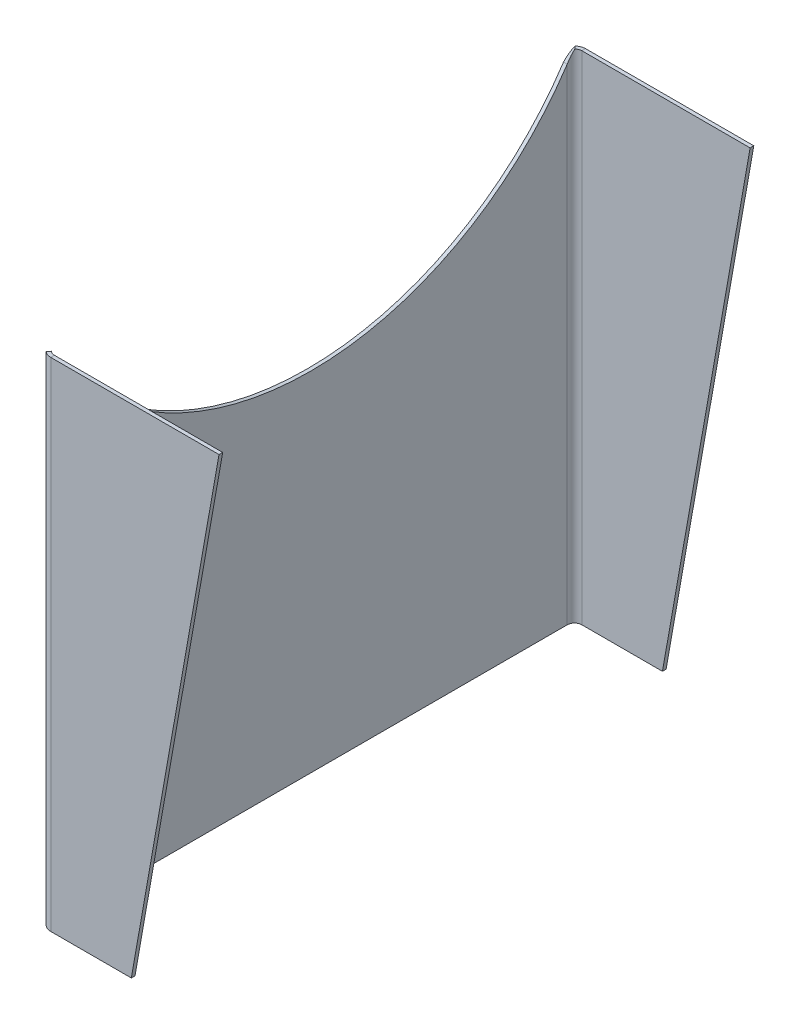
ISO-10303-21;
HEADER;
FILE_DESCRIPTION(('STEP AP214'),'2;1');
FILE_NAME('part.step','',(''),(''),'','','');
FILE_SCHEMA(('AUTOMOTIVE_DESIGN { 1 0 10303 214 1 1 1 1 }'));
ENDSEC;
DATA;
#1=APPLICATION_CONTEXT('core data for automotive mechanical design processes');
#2=APPLICATION_PROTOCOL_DEFINITION('international standard','automotive_design',2000,#1);
#3=PRODUCT_CONTEXT('',#1,'mechanical');
#4=PRODUCT('Part','Part','',(#3));
#5=PRODUCT_RELATED_PRODUCT_CATEGORY('part','',(#4));
#6=PRODUCT_DEFINITION_FORMATION('','',#4);
#7=PRODUCT_DEFINITION_CONTEXT('part definition',#1,'design');
#8=PRODUCT_DEFINITION('design','',#6,#7);
#9=PRODUCT_DEFINITION_SHAPE('','',#8);
#10=(LENGTH_UNIT() NAMED_UNIT(*) SI_UNIT(.MILLI.,.METRE.));
#11=(NAMED_UNIT(*) PLANE_ANGLE_UNIT() SI_UNIT($,.RADIAN.));
#12=(NAMED_UNIT(*) SI_UNIT($,.STERADIAN.) SOLID_ANGLE_UNIT());
#13=UNCERTAINTY_MEASURE_WITH_UNIT(LENGTH_MEASURE(1.E-05),#10,'distance_accuracy_value','');
#14=(GEOMETRIC_REPRESENTATION_CONTEXT(3) GLOBAL_UNCERTAINTY_ASSIGNED_CONTEXT((#13)) GLOBAL_UNIT_ASSIGNED_CONTEXT((#10,
#11,#12)) REPRESENTATION_CONTEXT('',''));
#15=CARTESIAN_POINT('',(0.,0.,0.));
#16=DIRECTION('',(0.,0.,1.));
#17=DIRECTION('',(1.,0.,0.));
#18=AXIS2_PLACEMENT_3D('',#15,#16,#17);
#19=CARTESIAN_POINT('',(-1219.2,-1136.65,-457.2));
#20=DIRECTION('',(1.,0.,0.));
#21=DIRECTION('',(0.,0.,-1.));
#22=AXIS2_PLACEMENT_3D('',#19,#20,#21);
#23=PLANE('',#22);
#24=DIRECTION('',(0.,1.,0.));
#25=VECTOR('',#24,1.);
#26=CARTESIAN_POINT('',(-1219.2,-1136.65,-444.5));
#27=LINE('',#26,#25);
#28=CARTESIAN_POINT('',(-1219.2,-1136.65,-444.5));
#29=VERTEX_POINT('',#28);
#30=CARTESIAN_POINT('',(-1219.2,-294.847943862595,-444.5));
#31=VERTEX_POINT('',#30);
#32=EDGE_CURVE('E470',#29,#31,#27,.T.);
#33=ORIENTED_EDGE('',*,*,#32,.T.);
#34=CARTESIAN_POINT('',(-1219.2,0.,0.));
#35=DIRECTION('',(1.,0.,0.));
#36=DIRECTION('',(0.,0.,-1.));
#37=AXIS2_PLACEMENT_3D('',#34,#35,#36);
#38=CIRCLE('',#37,533.4);
#39=CARTESIAN_POINT('',(-1219.2,-294.847943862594,444.5));
#40=VERTEX_POINT('',#39);
#41=EDGE_CURVE('E66',#40,#31,#38,.T.);
#42=ORIENTED_EDGE('',*,*,#41,.F.);
#43=DIRECTION('',(0.,1.,0.));
#44=VECTOR('',#43,1.);
#45=CARTESIAN_POINT('',(-1219.2,-1136.65,444.5));
#46=LINE('',#45,#44);
#47=CARTESIAN_POINT('',(-1219.2,-1136.65,444.5));
#48=VERTEX_POINT('',#47);
#49=EDGE_CURVE('E59',#48,#40,#46,.T.);
#50=ORIENTED_EDGE('',*,*,#49,.F.);
#51=DIRECTION('',(0.,0.,-1.));
#52=VECTOR('',#51,1.);
#53=CARTESIAN_POINT('',(-1219.2,-1136.65,-457.2));
#54=LINE('',#53,#52);
#55=EDGE_CURVE('E74',#48,#29,#54,.T.);
#56=ORIENTED_EDGE('',*,*,#55,.T.);
#57=EDGE_LOOP('',(#33,#42,#50,#56));
#58=FACE_BOUND('',#57,.T.);
#59=ADVANCED_FACE('F50',(#58),#23,.T.);
#60=CARTESIAN_POINT('',(-1225.55,-1136.65,-457.2));
#61=DIRECTION('',(1.,0.,0.));
#62=DIRECTION('',(0.,0.,-1.));
#63=AXIS2_PLACEMENT_3D('',#60,#61,#62);
#64=PLANE('',#63);
#65=CARTESIAN_POINT('',(-1225.55,0.,0.));
#66=DIRECTION('',(1.,0.,0.));
#67=DIRECTION('',(0.,0.,-1.));
#68=AXIS2_PLACEMENT_3D('',#65,#66,#67);
#69=CIRCLE('',#68,533.4);
#70=CARTESIAN_POINT('',(-1225.55,-294.847943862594,444.5));
#71=VERTEX_POINT('',#70);
#72=CARTESIAN_POINT('',(-1225.55,-294.847943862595,-444.5));
#73=VERTEX_POINT('',#72);
#74=EDGE_CURVE('E464',#71,#73,#69,.T.);
#75=ORIENTED_EDGE('',*,*,#74,.T.);
#76=DIRECTION('',(0.,1.,0.));
#77=VECTOR('',#76,1.);
#78=CARTESIAN_POINT('',(-1225.55,-1136.65,-444.5));
#79=LINE('',#78,#77);
#80=CARTESIAN_POINT('',(-1225.55,-1136.65,-444.5));
#81=VERTEX_POINT('',#80);
#82=EDGE_CURVE('E466',#81,#73,#79,.T.);
#83=ORIENTED_EDGE('',*,*,#82,.F.);
#84=DIRECTION('',(0.,0.,-1.));
#85=VECTOR('',#84,1.);
#86=CARTESIAN_POINT('',(-1225.55,-1136.65,-457.2));
#87=LINE('',#86,#85);
#88=CARTESIAN_POINT('',(-1225.55,-1136.65,444.5));
#89=VERTEX_POINT('',#88);
#90=EDGE_CURVE('E456',#89,#81,#87,.T.);
#91=ORIENTED_EDGE('',*,*,#90,.F.);
#92=DIRECTION('',(0.,1.,0.));
#93=VECTOR('',#92,1.);
#94=CARTESIAN_POINT('',(-1225.55,-1136.65,444.5));
#95=LINE('',#94,#93);
#96=EDGE_CURVE('E469',#89,#71,#95,.T.);
#97=ORIENTED_EDGE('',*,*,#96,.T.);
#98=EDGE_LOOP('',(#75,#83,#91,#97));
#99=FACE_BOUND('',#98,.T.);
#100=ADVANCED_FACE('F539',(#99),#64,.F.);
#101=CARTESIAN_POINT('',(-1206.5,-1136.65,463.55));
#102=DIRECTION('',(0.,-1.,0.));
#103=DIRECTION('',(0.,0.,-1.));
#104=AXIS2_PLACEMENT_3D('',#101,#102,#103);
#105=PLANE('',#104);
#106=ORIENTED_EDGE('',*,*,#55,.F.);
#107=DIRECTION('',(-1.,0.,0.));
#108=VECTOR('',#107,1.);
#109=CARTESIAN_POINT('',(-1219.2,-1136.65,444.5));
#110=LINE('',#109,#108);
#111=EDGE_CURVE('E504',#48,#89,#110,.T.);
#112=ORIENTED_EDGE('',*,*,#111,.T.);
#113=ORIENTED_EDGE('',*,*,#90,.T.);
#114=DIRECTION('',(1.,0.,0.));
#115=VECTOR('',#114,1.);
#116=CARTESIAN_POINT('',(-1225.55,-1136.65,-444.5));
#117=LINE('',#116,#115);
#118=EDGE_CURVE('E467',#81,#29,#117,.T.);
#119=ORIENTED_EDGE('',*,*,#118,.T.);
#120=EDGE_LOOP('',(#106,#112,#113,#119));
#121=FACE_BOUND('',#120,.T.);
#122=ADVANCED_FACE('F52',(#121),#105,.T.);
#123=CARTESIAN_POINT('',(-1219.2,0.,0.));
#124=DIRECTION('',(1.,0.,0.));
#125=DIRECTION('',(0.,0.,-1.));
#126=AXIS2_PLACEMENT_3D('',#123,#124,#125);
#127=CYLINDRICAL_SURFACE('',#126,533.4);
#128=ORIENTED_EDGE('',*,*,#41,.T.);
#129=CARTESIAN_POINT('',(-1225.55,-294.847943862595,-444.5));
#130=CARTESIAN_POINT('',(-1219.2,-294.847943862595,-444.5));
#131=B_SPLINE_CURVE_WITH_KNOTS('',1,(#129,#130),.UNSPECIFIED.,.F.,.F.,(2,2),(0.,1.),.UNSPECIFIED.);
#132=EDGE_CURVE('E452',#31,#73,#131,.F.);
#133=ORIENTED_EDGE('',*,*,#132,.T.);
#134=ORIENTED_EDGE('',*,*,#74,.F.);
#135=CARTESIAN_POINT('',(-1219.2,-294.847943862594,444.5));
#136=CARTESIAN_POINT('',(-1225.55,-294.847943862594,444.5));
#137=B_SPLINE_CURVE_WITH_KNOTS('',1,(#135,#136),.UNSPECIFIED.,.F.,.F.,(2,2),(0.,1.),.UNSPECIFIED.);
#138=EDGE_CURVE('E12',#40,#71,#137,.T.);
#139=ORIENTED_EDGE('',*,*,#138,.F.);
#140=EDGE_LOOP('',(#128,#133,#134,#139));
#141=FACE_BOUND('',#140,.T.);
#142=ADVANCED_FACE('F416',(#141),#127,.F.);
#143=CARTESIAN_POINT('',(-1225.55,-294.847943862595,-444.5));
#144=CARTESIAN_POINT('',(-1225.55,-293.414678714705,-445.670197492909));
#145=CARTESIAN_POINT('',(-1225.44567209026,-292.235169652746,-446.62791561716));
#146=CARTESIAN_POINT('',(-1225.21935583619,-290.381281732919,-448.112787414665));
#147=CARTESIAN_POINT('',(-1225.09738666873,-289.707299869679,-448.641259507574));
#148=CARTESIAN_POINT('',(-1225.0000931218,-289.181025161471,-449.044881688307));
#149=CARTESIAN_POINT('',(-1224.98318728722,-289.091580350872,-449.112756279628));
#150=CARTESIAN_POINT('',(-1224.96228928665,-288.981128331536,-449.195442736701));
#151=CARTESIAN_POINT('',(-1224.95606425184,-288.948263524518,-449.219816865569));
#152=CARTESIAN_POINT('',(-1224.94925633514,-288.912123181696,-449.24631126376));
#153=CARTESIAN_POINT('',(-1224.94943733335,-288.913045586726,-449.245646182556));
#154=CARTESIAN_POINT('',(-1224.93948737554,-288.860206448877,-449.284161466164));
#155=CARTESIAN_POINT('',(-1224.93448223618,-288.833790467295,-449.303411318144));
#156=CARTESIAN_POINT('',(-1224.91937641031,-288.754553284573,-449.361137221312));
#157=CARTESIAN_POINT('',(-1224.90918531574,-288.701742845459,-449.399589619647));
#158=CARTESIAN_POINT('',(-1224.81638236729,-288.226578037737,-449.745370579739));
#159=CARTESIAN_POINT('',(-1224.72618725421,-287.805127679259,-450.050664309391));
#160=CARTESIAN_POINT('',(-1224.43283059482,-286.543531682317,-450.959194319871));
#161=CARTESIAN_POINT('',(-1224.20687905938,-285.706141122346,-451.555072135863));
#162=CARTESIAN_POINT('',(-1223.69648079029,-284.038706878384,-452.721232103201));
#163=CARTESIAN_POINT('',(-1223.41451624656,-283.216122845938,-453.287585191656));
#164=CARTESIAN_POINT('',(-1222.77818951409,-281.529136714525,-454.416806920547));
#165=CARTESIAN_POINT('',(-1222.43118982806,-280.684229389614,-454.965166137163));
#166=CARTESIAN_POINT('',(-1221.30909556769,-278.145264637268,-456.552934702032));
#167=CARTESIAN_POINT('',(-1220.45265485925,-276.446972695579,-457.534798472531));
#168=CARTESIAN_POINT('',(-1219.50555484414,-274.743007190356,-458.419699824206));
#169=CARTESIAN_POINT('',(-1219.2,-294.847943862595,-444.5));
#170=CARTESIAN_POINT('',(-1219.2,-293.414848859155,-445.280039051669));
#171=CARTESIAN_POINT('',(-1219.13044806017,-292.235169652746,-445.91861041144));
#172=CARTESIAN_POINT('',(-1218.97957055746,-290.381281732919,-446.90852494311));
#173=CARTESIAN_POINT('',(-1218.89825777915,-289.707299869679,-447.260839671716));
#174=CARTESIAN_POINT('',(-1218.83339541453,-289.181025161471,-447.529921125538));
#175=CARTESIAN_POINT('',(-1218.82212485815,-289.091580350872,-447.575170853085));
#176=CARTESIAN_POINT('',(-1218.80819285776,-288.981128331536,-447.630295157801));
#177=CARTESIAN_POINT('',(-1218.80404283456,-288.948263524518,-447.646544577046));
#178=CARTESIAN_POINT('',(-1218.79950422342,-288.912123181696,-447.664207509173));
#179=CARTESIAN_POINT('',(-1218.7996248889,-288.913045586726,-447.663764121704));
#180=CARTESIAN_POINT('',(-1218.7929915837,-288.860206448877,-447.689440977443));
#181=CARTESIAN_POINT('',(-1218.78965482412,-288.833790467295,-447.702274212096));
#182=CARTESIAN_POINT('',(-1218.77958427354,-288.754553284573,-447.740758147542));
#183=CARTESIAN_POINT('',(-1218.7727902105,-288.701742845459,-447.766393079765));
#184=CARTESIAN_POINT('',(-1218.71092157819,-288.226578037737,-447.996913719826));
#185=CARTESIAN_POINT('',(-1218.65079150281,-287.805127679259,-448.200442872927));
#186=CARTESIAN_POINT('',(-1218.45522039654,-286.543531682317,-448.80612954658));
#187=CARTESIAN_POINT('',(-1218.30458603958,-285.706141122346,-449.203381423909));
#188=CARTESIAN_POINT('',(-1217.96432052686,-284.038706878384,-449.980821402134));
#189=CARTESIAN_POINT('',(-1217.77634416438,-283.216122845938,-450.358390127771));
#190=CARTESIAN_POINT('',(-1217.35212634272,-281.529136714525,-451.111204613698));
#191=CARTESIAN_POINT('',(-1217.12079321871,-280.684229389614,-451.476777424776));
#192=CARTESIAN_POINT('',(-1216.37273037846,-278.145264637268,-452.535289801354));
#193=CARTESIAN_POINT('',(-1215.80176855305,-276.446969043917,-453.189866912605));
#194=CARTESIAN_POINT('',(-1215.1703698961,-274.743007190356,-453.779799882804));
#195=B_SPLINE_SURFACE_WITH_KNOTS('',1,3,((#143,#144,#145,#146,#147,#148,#149,#150,#151,#152,
#153,#154,#155,#156,#157,#158,#159,#160,#161,#162,#163,#164,#165,#166,#167,#168),(#169,#170,
#171,#172,#173,#174,#175,#176,#177,#178,#179,#180,#181,#182,#183,#184,#185,#186,#187,#188,#189,
#190,#191,#192,#193,#194)),.UNSPECIFIED.,.F.,.F.,.F.,(2,2),(4,2,2,2,2,2,2,2,2,2,2,2,4),(0.,1.),
(0.,0.125,0.25,0.28125,0.296875,0.30078125,0.3046875,0.3125,0.375,0.5,0.625,0.75,1.),.UNSPECIFIED.);
#196=CARTESIAN_POINT('',(-1219.2,-294.847943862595,-444.5));
#197=CARTESIAN_POINT('',(-1219.2,-293.414848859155,-445.280039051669));
#198=CARTESIAN_POINT('',(-1219.13044806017,-292.235169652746,-445.91861041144));
#199=CARTESIAN_POINT('',(-1218.97957055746,-290.381281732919,-446.90852494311));
#200=CARTESIAN_POINT('',(-1218.89825777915,-289.707299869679,-447.260839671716));
#201=CARTESIAN_POINT('',(-1218.83339541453,-289.181025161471,-447.529921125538));
#202=CARTESIAN_POINT('',(-1218.82212485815,-289.091580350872,-447.575170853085));
#203=CARTESIAN_POINT('',(-1218.80819285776,-288.981128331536,-447.630295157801));
#204=CARTESIAN_POINT('',(-1218.80404283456,-288.948263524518,-447.646544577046));
#205=CARTESIAN_POINT('',(-1218.79950422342,-288.912123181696,-447.664207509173));
#206=CARTESIAN_POINT('',(-1218.7996248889,-288.913045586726,-447.663764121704));
#207=CARTESIAN_POINT('',(-1218.7929915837,-288.860206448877,-447.689440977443));
#208=CARTESIAN_POINT('',(-1218.78965482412,-288.833790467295,-447.702274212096));
#209=CARTESIAN_POINT('',(-1218.77958427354,-288.754553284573,-447.740758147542));
#210=CARTESIAN_POINT('',(-1218.7727902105,-288.701742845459,-447.766393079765));
#211=CARTESIAN_POINT('',(-1218.71092157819,-288.226578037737,-447.996913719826));
#212=CARTESIAN_POINT('',(-1218.65079150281,-287.805127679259,-448.200442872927));
#213=CARTESIAN_POINT('',(-1218.45522039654,-286.543531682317,-448.80612954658));
#214=CARTESIAN_POINT('',(-1218.30458603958,-285.706141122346,-449.203381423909));
#215=CARTESIAN_POINT('',(-1217.96432052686,-284.038706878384,-449.980821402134));
#216=CARTESIAN_POINT('',(-1217.77634416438,-283.216122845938,-450.358390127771));
#217=CARTESIAN_POINT('',(-1217.35212634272,-281.529136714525,-451.111204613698));
#218=CARTESIAN_POINT('',(-1217.12079321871,-280.684229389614,-451.476777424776));
#219=CARTESIAN_POINT('',(-1216.37273037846,-278.145264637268,-452.535289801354));
#220=CARTESIAN_POINT('',(-1215.80176855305,-276.446969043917,-453.189866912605));
#221=CARTESIAN_POINT('',(-1215.1703698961,-274.743007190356,-453.779799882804));
#222=B_SPLINE_CURVE_WITH_KNOTS('',3,(#196,#197,#198,#199,#200,#201,#202,#203,#204,#205,#206,
#207,#208,#209,#210,#211,#212,#213,#214,#215,#216,#217,#218,#219,#220,#221),.UNSPECIFIED.,.F.,
.F.,(4,2,2,2,2,2,2,2,2,2,2,2,4),(0.,0.125,0.25,0.28125,0.296875,0.30078125,0.3046875,0.3125,
0.375,0.5,0.625,0.75,1.),.UNSPECIFIED.);
#223=CARTESIAN_POINT('',(-1215.1703698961,-274.743007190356,-453.779799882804));
#224=VERTEX_POINT('',#223);
#225=EDGE_CURVE('E312',#31,#224,#222,.T.);
#226=CARTESIAN_POINT('',(-1215.1703698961,-274.743007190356,-453.779799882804));
#227=CARTESIAN_POINT('',(-1219.50555484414,-274.743007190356,-458.419699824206));
#228=B_SPLINE_CURVE_WITH_KNOTS('',1,(#226,#227),.UNSPECIFIED.,.F.,.F.,(2,2),(0.,1.),.UNSPECIFIED.);
#229=CARTESIAN_POINT('',(-1219.50555484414,-274.743007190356,-458.419699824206));
#230=VERTEX_POINT('',#229);
#231=EDGE_CURVE('E345',#224,#230,#228,.T.);
#232=CARTESIAN_POINT('',(-1219.50555484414,-274.743007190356,-458.419699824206));
#233=CARTESIAN_POINT('',(-1220.45265485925,-276.446972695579,-457.534798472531));
#234=CARTESIAN_POINT('',(-1221.30909556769,-278.145264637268,-456.552934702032));
#235=CARTESIAN_POINT('',(-1222.43118982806,-280.684229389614,-454.965166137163));
#236=CARTESIAN_POINT('',(-1222.77818951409,-281.529136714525,-454.416806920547));
#237=CARTESIAN_POINT('',(-1223.41451624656,-283.216122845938,-453.287585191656));
#238=CARTESIAN_POINT('',(-1223.69648079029,-284.038706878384,-452.721232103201));
#239=CARTESIAN_POINT('',(-1224.20687905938,-285.706141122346,-451.555072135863));
#240=CARTESIAN_POINT('',(-1224.43283059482,-286.543531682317,-450.959194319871));
#241=CARTESIAN_POINT('',(-1224.72618725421,-287.805127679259,-450.050664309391));
#242=CARTESIAN_POINT('',(-1224.81638236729,-288.226578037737,-449.745370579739));
#243=CARTESIAN_POINT('',(-1224.90918531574,-288.701742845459,-449.399589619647));
#244=CARTESIAN_POINT('',(-1224.91937641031,-288.754553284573,-449.361137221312));
#245=CARTESIAN_POINT('',(-1224.93448223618,-288.833790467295,-449.303411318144));
#246=CARTESIAN_POINT('',(-1224.93948737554,-288.860206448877,-449.284161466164));
#247=CARTESIAN_POINT('',(-1224.94943733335,-288.913045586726,-449.245646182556));
#248=CARTESIAN_POINT('',(-1224.94925633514,-288.912123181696,-449.24631126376));
#249=CARTESIAN_POINT('',(-1224.95606425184,-288.948263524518,-449.219816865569));
#250=CARTESIAN_POINT('',(-1224.96228928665,-288.981128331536,-449.195442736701));
#251=CARTESIAN_POINT('',(-1224.98318728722,-289.091580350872,-449.112756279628));
#252=CARTESIAN_POINT('',(-1225.0000931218,-289.181025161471,-449.044881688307));
#253=CARTESIAN_POINT('',(-1225.09738666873,-289.707299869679,-448.641259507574));
#254=CARTESIAN_POINT('',(-1225.21935583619,-290.381281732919,-448.112787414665));
#255=CARTESIAN_POINT('',(-1225.44567209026,-292.235169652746,-446.62791561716));
#256=CARTESIAN_POINT('',(-1225.55,-293.414678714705,-445.670197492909));
#257=CARTESIAN_POINT('',(-1225.55,-294.847943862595,-444.5));
#258=B_SPLINE_CURVE_WITH_KNOTS('',3,(#232,#233,#234,#235,#236,#237,#238,#239,#240,#241,#242,
#243,#244,#245,#246,#247,#248,#249,#250,#251,#252,#253,#254,#255,#256,#257),.UNSPECIFIED.,.F.,
.F.,(4,2,2,2,2,2,2,2,2,2,2,2,4),(0.,0.25,0.375,0.5,0.625,0.6875,0.6953125,0.69921875,0.703125,
0.71875,0.75,0.875,1.),.UNSPECIFIED.);
#259=EDGE_CURVE('E349',#73,#230,#258,.F.);
#260=ORIENTED_EDGE('',*,*,#132,.F.);
#261=ORIENTED_EDGE('',*,*,#225,.T.);
#262=ORIENTED_EDGE('',*,*,#231,.T.);
#263=ORIENTED_EDGE('',*,*,#259,.F.);
#264=EDGE_LOOP('',(#260,#261,#262,#263));
#265=FACE_BOUND('',#264,.T.);
#266=ADVANCED_FACE('F405',(#265),#195,.T.);
#267=CARTESIAN_POINT('',(-1206.5,-274.743007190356,-444.5));
#268=DIRECTION('',(0.,1.,0.));
#269=DIRECTION('',(0.,0.,1.));
#270=AXIS2_PLACEMENT_3D('',#267,#268,#269);
#271=PLANE('',#270);
#272=ORIENTED_EDGE('',*,*,#231,.F.);
#273=CARTESIAN_POINT('',(-1206.5,-274.743007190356,-444.5));
#274=DIRECTION('',(0.,-1.,0.));
#275=DIRECTION('',(0.,0.,-1.));
#276=AXIS2_PLACEMENT_3D('',#273,#274,#275);
#277=CIRCLE('',#276,12.7);
#278=CARTESIAN_POINT('',(-1206.5,-274.743007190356,-457.2));
#279=VERTEX_POINT('',#278);
#280=EDGE_CURVE('E350',#224,#279,#277,.T.);
#281=ORIENTED_EDGE('',*,*,#280,.T.);
#282=DIRECTION('',(0.,0.,1.));
#283=VECTOR('',#282,1.);
#284=CARTESIAN_POINT('',(-1206.5,-274.743007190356,-463.55));
#285=LINE('',#284,#283);
#286=CARTESIAN_POINT('',(-1206.5,-274.743007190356,-463.55));
#287=VERTEX_POINT('',#286);
#288=EDGE_CURVE('E324',#287,#279,#285,.T.);
#289=ORIENTED_EDGE('',*,*,#288,.F.);
#290=CARTESIAN_POINT('',(-1206.5,-274.743007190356,-444.5));
#291=DIRECTION('',(0.,-1.,0.));
#292=DIRECTION('',(0.,0.,-1.));
#293=AXIS2_PLACEMENT_3D('',#290,#291,#292);
#294=CIRCLE('',#293,19.05);
#295=EDGE_CURVE('E346',#230,#287,#294,.T.);
#296=ORIENTED_EDGE('',*,*,#295,.F.);
#297=EDGE_LOOP('',(#272,#281,#289,#296));
#298=FACE_BOUND('',#297,.T.);
#299=ADVANCED_FACE('F381',(#298),#271,.T.);
#300=CARTESIAN_POINT('',(-1206.5,-1136.65,-444.5));
#301=DIRECTION('',(0.,-1.,0.));
#302=DIRECTION('',(0.,0.,-1.));
#303=AXIS2_PLACEMENT_3D('',#300,#301,#302);
#304=PLANE('',#303);
#305=CARTESIAN_POINT('',(-1206.5,-1136.65,-444.5));
#306=DIRECTION('',(0.,-1.,0.));
#307=DIRECTION('',(0.,0.,-1.));
#308=AXIS2_PLACEMENT_3D('',#305,#306,#307);
#309=CIRCLE('',#308,12.7);
#310=CARTESIAN_POINT('',(-1206.5,-1136.65,-457.2));
#311=VERTEX_POINT('',#310);
#312=EDGE_CURVE('E347',#311,#29,#309,.F.);
#313=ORIENTED_EDGE('',*,*,#312,.T.);
#314=ORIENTED_EDGE('',*,*,#118,.F.);
#315=CARTESIAN_POINT('',(-1206.5,-1136.65,-444.5));
#316=DIRECTION('',(0.,1.,0.));
#317=DIRECTION('',(0.,0.,1.));
#318=AXIS2_PLACEMENT_3D('',#315,#316,#317);
#319=CIRCLE('',#318,19.05);
#320=CARTESIAN_POINT('',(-1206.5,-1136.65,-463.55));
#321=VERTEX_POINT('',#320);
#322=EDGE_CURVE('E342',#321,#81,#319,.T.);
#323=ORIENTED_EDGE('',*,*,#322,.F.);
#324=DIRECTION('',(0.,0.,-1.));
#325=VECTOR('',#324,1.);
#326=CARTESIAN_POINT('',(-1206.5,-1136.65,-457.2));
#327=LINE('',#326,#325);
#328=EDGE_CURVE('E305',#311,#321,#327,.T.);
#329=ORIENTED_EDGE('',*,*,#328,.F.);
#330=EDGE_LOOP('',(#313,#314,#323,#329));
#331=FACE_BOUND('',#330,.T.);
#332=ADVANCED_FACE('F372',(#331),#304,.T.);
#333=CARTESIAN_POINT('',(-1206.5,146.525234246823,-444.5));
#334=DIRECTION('',(0.,-1.,0.));
#335=DIRECTION('',(0.,0.,-1.));
#336=AXIS2_PLACEMENT_3D('',#333,#334,#335);
#337=CYLINDRICAL_SURFACE('',#336,19.05);
#338=DIRECTION('',(0.,1.,0.));
#339=VECTOR('',#338,1.);
#340=CARTESIAN_POINT('',(-1206.5,-1136.65,-463.55));
#341=LINE('',#340,#339);
#342=EDGE_CURVE('E331',#321,#287,#341,.T.);
#343=ORIENTED_EDGE('',*,*,#342,.F.);
#344=ORIENTED_EDGE('',*,*,#322,.T.);
#345=ORIENTED_EDGE('',*,*,#82,.T.);
#346=ORIENTED_EDGE('',*,*,#259,.T.);
#347=ORIENTED_EDGE('',*,*,#295,.T.);
#348=EDGE_LOOP('',(#343,#344,#345,#346,#347));
#349=FACE_BOUND('',#348,.T.);
#350=ADVANCED_FACE('F361',(#349),#337,.T.);
#351=CARTESIAN_POINT('',(-1206.5,146.525234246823,-444.5));
#352=DIRECTION('',(0.,-1.,0.));
#353=DIRECTION('',(0.,0.,-1.));
#354=AXIS2_PLACEMENT_3D('',#351,#352,#353);
#355=CYLINDRICAL_SURFACE('',#354,12.7);
#356=DIRECTION('',(0.,1.,0.));
#357=VECTOR('',#356,1.);
#358=CARTESIAN_POINT('',(-1206.5,-1136.65,-457.2));
#359=LINE('',#358,#357);
#360=EDGE_CURVE('E339',#311,#279,#359,.T.);
#361=ORIENTED_EDGE('',*,*,#360,.T.);
#362=ORIENTED_EDGE('',*,*,#280,.F.);
#363=ORIENTED_EDGE('',*,*,#225,.F.);
#364=ORIENTED_EDGE('',*,*,#32,.F.);
#365=ORIENTED_EDGE('',*,*,#312,.F.);
#366=EDGE_LOOP('',(#361,#362,#363,#364,#365));
#367=FACE_BOUND('',#366,.T.);
#368=ADVANCED_FACE('F371',(#367),#355,.F.);
#369=CARTESIAN_POINT('',(-1066.8,-1136.65,-1187.97202403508));
#370=DIRECTION('',(0.984807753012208,-0.173648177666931,0.));
#371=DIRECTION('',(0.173648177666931,0.984807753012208,0.));
#372=AXIS2_PLACEMENT_3D('',#369,#370,#371);
#373=PLANE('',#372);
#374=DIRECTION('',(0.173648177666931,0.984807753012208,0.));
#375=VECTOR('',#374,1.);
#376=CARTESIAN_POINT('',(-1071.39542229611,-1162.71193492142,-457.2));
#377=LINE('',#376,#375);
#378=CARTESIAN_POINT('',(-1066.8,-1136.65,-457.2));
#379=VERTEX_POINT('',#378);
#380=CARTESIAN_POINT('',(-914.822542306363,-274.743007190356,-457.2));
#381=VERTEX_POINT('',#380);
#382=EDGE_CURVE('E318',#379,#381,#377,.T.);
#383=ORIENTED_EDGE('',*,*,#382,.F.);
#384=DIRECTION('',(0.,0.,1.));
#385=VECTOR('',#384,1.);
#386=CARTESIAN_POINT('',(-1066.8,-1136.65,-1187.97202403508));
#387=LINE('',#386,#385);
#388=CARTESIAN_POINT('',(-1066.8,-1136.65,-463.55));
#389=VERTEX_POINT('',#388);
#390=EDGE_CURVE('E313',#389,#379,#387,.T.);
#391=ORIENTED_EDGE('',*,*,#390,.F.);
#392=DIRECTION('',(0.173648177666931,0.984807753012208,0.));
#393=VECTOR('',#392,1.);
#394=CARTESIAN_POINT('',(-1071.39542229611,-1162.71193492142,-463.55));
#395=LINE('',#394,#393);
#396=CARTESIAN_POINT('',(-914.822542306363,-274.743007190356,-463.550000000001));
#397=VERTEX_POINT('',#396);
#398=EDGE_CURVE('E336',#389,#397,#395,.T.);
#399=ORIENTED_EDGE('',*,*,#398,.T.);
#400=DIRECTION('',(0.,0.,1.));
#401=VECTOR('',#400,1.);
#402=CARTESIAN_POINT('',(-914.822542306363,-274.743007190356,-463.550000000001));
#403=LINE('',#402,#401);
#404=EDGE_CURVE('E333',#397,#381,#403,.T.);
#405=ORIENTED_EDGE('',*,*,#404,.T.);
#406=EDGE_LOOP('',(#383,#391,#399,#405));
#407=FACE_BOUND('',#406,.T.);
#408=ADVANCED_FACE('F379',(#407),#373,.T.);
#409=CARTESIAN_POINT('',(-1219.2,-1136.65,-463.55));
#410=DIRECTION('',(0.,0.,1.));
#411=DIRECTION('',(1.,0.,0.));
#412=AXIS2_PLACEMENT_3D('',#409,#410,#411);
#413=PLANE('',#412);
#414=ORIENTED_EDGE('',*,*,#398,.F.);
#415=DIRECTION('',(1.,0.,0.));
#416=VECTOR('',#415,1.);
#417=CARTESIAN_POINT('',(-1219.2,-1136.65,-463.55));
#418=LINE('',#417,#416);
#419=EDGE_CURVE('E315',#321,#389,#418,.T.);
#420=ORIENTED_EDGE('',*,*,#419,.F.);
#421=ORIENTED_EDGE('',*,*,#342,.T.);
#422=DIRECTION('',(1.,0.,0.));
#423=VECTOR('',#422,1.);
#424=CARTESIAN_POINT('',(-1219.2,-274.743007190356,-463.55));
#425=LINE('',#424,#423);
#426=EDGE_CURVE('E329',#287,#397,#425,.T.);
#427=ORIENTED_EDGE('',*,*,#426,.T.);
#428=EDGE_LOOP('',(#414,#420,#421,#427));
#429=FACE_BOUND('',#428,.T.);
#430=ADVANCED_FACE('F537',(#429),#413,.F.);
#431=CARTESIAN_POINT('',(-1206.5,-274.743007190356,-444.5));
#432=DIRECTION('',(0.,1.,0.));
#433=DIRECTION('',(-1.,0.,0.));
#434=AXIS2_PLACEMENT_3D('',#431,#432,#433);
#435=PLANE('',#434);
#436=DIRECTION('',(1.,0.,0.));
#437=VECTOR('',#436,1.);
#438=CARTESIAN_POINT('',(-1219.2,-274.743007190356,-457.2));
#439=LINE('',#438,#437);
#440=EDGE_CURVE('E327',#279,#381,#439,.T.);
#441=ORIENTED_EDGE('',*,*,#440,.T.);
#442=ORIENTED_EDGE('',*,*,#404,.F.);
#443=ORIENTED_EDGE('',*,*,#426,.F.);
#444=ORIENTED_EDGE('',*,*,#288,.T.);
#445=EDGE_LOOP('',(#441,#442,#443,#444));
#446=FACE_BOUND('',#445,.T.);
#447=ADVANCED_FACE('F524',(#446),#435,.T.);
#448=CARTESIAN_POINT('',(-1219.2,-1136.65,-457.2));
#449=DIRECTION('',(0.,0.,1.));
#450=DIRECTION('',(1.,0.,0.));
#451=AXIS2_PLACEMENT_3D('',#448,#449,#450);
#452=PLANE('',#451);
#453=DIRECTION('',(1.,0.,0.));
#454=VECTOR('',#453,1.);
#455=CARTESIAN_POINT('',(-1219.2,-1136.65,-457.2));
#456=LINE('',#455,#454);
#457=EDGE_CURVE('E321',#311,#379,#456,.T.);
#458=ORIENTED_EDGE('',*,*,#457,.T.);
#459=ORIENTED_EDGE('',*,*,#382,.T.);
#460=ORIENTED_EDGE('',*,*,#440,.F.);
#461=ORIENTED_EDGE('',*,*,#360,.F.);
#462=EDGE_LOOP('',(#458,#459,#460,#461));
#463=FACE_BOUND('',#462,.T.);
#464=ADVANCED_FACE('F529',(#463),#452,.T.);
#465=CARTESIAN_POINT('',(-1225.55,-1136.65,-444.5));
#466=DIRECTION('',(0.,-1.,0.));
#467=DIRECTION('',(0.,0.,-1.));
#468=AXIS2_PLACEMENT_3D('',#465,#466,#467);
#469=PLANE('',#468);
#470=ORIENTED_EDGE('',*,*,#419,.T.);
#471=ORIENTED_EDGE('',*,*,#390,.T.);
#472=ORIENTED_EDGE('',*,*,#457,.F.);
#473=ORIENTED_EDGE('',*,*,#328,.T.);
#474=EDGE_LOOP('',(#470,#471,#472,#473));
#475=FACE_BOUND('',#474,.T.);
#476=ADVANCED_FACE('F374',(#475),#469,.T.);
#477=CARTESIAN_POINT('',(-1206.5,-274.743007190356,444.5));
#478=DIRECTION('',(0.,1.,0.));
#479=DIRECTION('',(0.,0.,1.));
#480=AXIS2_PLACEMENT_3D('',#477,#478,#479);
#481=PLANE('',#480);
#482=DIRECTION('',(0.,0.,1.));
#483=VECTOR('',#482,1.);
#484=CARTESIAN_POINT('',(-1206.5,-274.743007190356,457.200000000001));
#485=LINE('',#484,#483);
#486=CARTESIAN_POINT('',(-1206.5,-274.743007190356,457.200000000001));
#487=VERTEX_POINT('',#486);
#488=CARTESIAN_POINT('',(-1206.5,-274.743007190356,463.550000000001));
#489=VERTEX_POINT('',#488);
#490=EDGE_CURVE('E176',#487,#489,#485,.T.);
#491=ORIENTED_EDGE('',*,*,#490,.F.);
#492=CARTESIAN_POINT('',(-1206.5,-274.743007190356,444.5));
#493=DIRECTION('',(0.,1.,0.));
#494=DIRECTION('',(0.,0.,1.));
#495=AXIS2_PLACEMENT_3D('',#492,#493,#494);
#496=CIRCLE('',#495,12.7);
#497=CARTESIAN_POINT('',(-1215.1703698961,-274.743007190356,453.779799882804));
#498=VERTEX_POINT('',#497);
#499=EDGE_CURVE('E237',#487,#498,#496,.F.);
#500=ORIENTED_EDGE('',*,*,#499,.T.);
#501=CARTESIAN_POINT('',(-1219.50555484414,-274.743007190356,458.419699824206));
#502=CARTESIAN_POINT('',(-1215.1703698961,-274.743007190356,453.779799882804));
#503=B_SPLINE_CURVE_WITH_KNOTS('',1,(#501,#502),.UNSPECIFIED.,.F.,.F.,(2,2),(0.,1.),.UNSPECIFIED.);
#504=CARTESIAN_POINT('',(-1219.50555484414,-274.743007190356,458.419699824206));
#505=VERTEX_POINT('',#504);
#506=EDGE_CURVE('E198',#498,#505,#503,.F.);
#507=ORIENTED_EDGE('',*,*,#506,.T.);
#508=CARTESIAN_POINT('',(-1206.5,-274.743007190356,444.5));
#509=DIRECTION('',(0.,-1.,0.));
#510=DIRECTION('',(0.,0.,-1.));
#511=AXIS2_PLACEMENT_3D('',#508,#509,#510);
#512=CIRCLE('',#511,19.05);
#513=EDGE_CURVE('E203',#489,#505,#512,.T.);
#514=ORIENTED_EDGE('',*,*,#513,.F.);
#515=EDGE_LOOP('',(#491,#500,#507,#514));
#516=FACE_BOUND('',#515,.T.);
#517=ADVANCED_FACE('F266',(#516),#481,.T.);
#518=CARTESIAN_POINT('',(-1219.50555484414,-274.743007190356,458.419699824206));
#519=CARTESIAN_POINT('',(-1220.43444674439,-276.447794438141,457.551810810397));
#520=CARTESIAN_POINT('',(-1221.27614623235,-278.144356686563,456.590660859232));
#521=CARTESIAN_POINT('',(-1222.38277295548,-280.676896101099,455.037743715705));
#522=CARTESIAN_POINT('',(-1222.72571944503,-281.519023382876,454.501627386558));
#523=CARTESIAN_POINT('',(-1223.19867187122,-282.779135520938,453.673759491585));
#524=CARTESIAN_POINT('',(-1223.34941563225,-283.198659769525,453.393857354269));
#525=CARTESIAN_POINT('',(-1223.56488755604,-283.827176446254,452.968610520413));
#526=CARTESIAN_POINT('',(-1223.63493785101,-284.036553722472,452.825962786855));
#527=CARTESIAN_POINT('',(-1223.73731986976,-284.350427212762,452.610709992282));
#528=CARTESIAN_POINT('',(-1223.77099832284,-284.455019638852,452.538745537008));
#529=CARTESIAN_POINT('',(-1223.82083871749,-284.611860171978,452.430487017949));
#530=CARTESIAN_POINT('',(-1223.83733930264,-284.664132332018,452.394348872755));
#531=CARTESIAN_POINT('',(-1223.86192037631,-284.742528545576,452.340064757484));
#532=CARTESIAN_POINT('',(-1223.87008576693,-284.768658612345,452.321957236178));
#533=CARTESIAN_POINT('',(-1223.882291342,-284.807850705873,452.294776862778));
#534=CARTESIAN_POINT('',(-1223.88635278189,-284.820914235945,452.285713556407));
#535=CARTESIAN_POINT('',(-1223.89243430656,-284.840508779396,452.272113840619));
#536=CARTESIAN_POINT('',(-1223.89445970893,-284.847040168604,452.267579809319));
#537=CARTESIAN_POINT('',(-1223.89850696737,-284.860102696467,452.25851016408));
#538=CARTESIAN_POINT('',(-1223.90176420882,-284.870627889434,452.251200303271));
#539=CARTESIAN_POINT('',(-1224.10343131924,-285.522626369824,451.79832595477));
#540=CARTESIAN_POINT('',(-1224.47091468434,-286.678588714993,450.958947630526));
#541=CARTESIAN_POINT('',(-1225.01333024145,-289.172283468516,449.038879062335));
#542=CARTESIAN_POINT('',(-1225.18999022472,-290.130140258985,448.288259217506));
#543=CARTESIAN_POINT('',(-1225.45838198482,-292.299104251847,446.560678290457));
#544=CARTESIAN_POINT('',(-1225.55,-293.509993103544,445.58341044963));
#545=CARTESIAN_POINT('',(-1225.55,-294.847943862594,444.5));
#546=CARTESIAN_POINT('',(-1215.1703698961,-274.743007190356,453.779799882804));
#547=CARTESIAN_POINT('',(-1215.78962995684,-276.44779111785,453.201208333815));
#548=CARTESIAN_POINT('',(-1216.3507641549,-278.144356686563,452.560440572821));
#549=CARTESIAN_POINT('',(-1217.08851530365,-280.676896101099,451.525162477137));
#550=CARTESIAN_POINT('',(-1217.31714629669,-281.519023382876,451.167751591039));
#551=CARTESIAN_POINT('',(-1217.63244791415,-282.779135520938,450.615839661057));
#552=CARTESIAN_POINT('',(-1217.73294375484,-283.198659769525,450.42923823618));
#553=CARTESIAN_POINT('',(-1217.87659170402,-283.827176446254,450.145740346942));
#554=CARTESIAN_POINT('',(-1217.92329190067,-284.036553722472,450.050641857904));
#555=CARTESIAN_POINT('',(-1217.99154657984,-284.350427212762,449.907139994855));
#556=CARTESIAN_POINT('',(-1218.0139988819,-284.455019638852,449.859163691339));
#557=CARTESIAN_POINT('',(-1218.04722581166,-284.611860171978,449.786991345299));
#558=CARTESIAN_POINT('',(-1218.05822620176,-284.664132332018,449.762899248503));
#559=CARTESIAN_POINT('',(-1218.07461358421,-284.742528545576,449.726709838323));
#560=CARTESIAN_POINT('',(-1218.08005717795,-284.768658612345,449.714638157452));
#561=CARTESIAN_POINT('',(-1218.088194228,-284.807850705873,449.696517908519));
#562=CARTESIAN_POINT('',(-1218.09090185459,-284.820914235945,449.690475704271));
#563=CARTESIAN_POINT('',(-1218.09495620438,-284.840508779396,449.68140922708));
#564=CARTESIAN_POINT('',(-1218.09630647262,-284.847040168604,449.678386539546));
#565=CARTESIAN_POINT('',(-1218.09900464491,-284.860102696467,449.672340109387));
#566=CARTESIAN_POINT('',(-1218.10117613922,-284.870627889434,449.667466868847));
#567=CARTESIAN_POINT('',(-1218.2356208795,-285.522626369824,449.365550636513));
#568=CARTESIAN_POINT('',(-1218.48060978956,-286.678588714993,448.805965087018));
#569=CARTESIAN_POINT('',(-1218.84222016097,-289.172283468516,447.52591937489));
#570=CARTESIAN_POINT('',(-1218.95999348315,-290.130140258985,447.025506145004));
#571=CARTESIAN_POINT('',(-1219.13892132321,-292.299104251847,445.873785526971));
#572=CARTESIAN_POINT('',(-1219.2,-293.510087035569,445.222222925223));
#573=CARTESIAN_POINT('',(-1219.2,-294.847943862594,444.5));
#574=B_SPLINE_SURFACE_WITH_KNOTS('',1,3,((#518,#519,#520,#521,#522,#523,#524,#525,#526,#527,
#528,#529,#530,#531,#532,#533,#534,#535,#536,#537,#538,#539,#540,#541,#542,#543,#544,#545),
(#546,#547,#548,#549,#550,#551,#552,#553,#554,#555,#556,#557,#558,#559,#560,#561,#562,#563,#564,
#565,#566,#567,#568,#569,#570,#571,#572,#573)),.UNSPECIFIED.,.F.,.F.,.F.,(2,2),(4,2,2,2,2,2,2,2,
2,2,2,2,2,4),(0.,1.),(0.,0.25,0.375,0.4375,0.46875,0.484375,0.4921875,0.49609375,0.498046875,
0.4990234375,0.5,0.75,0.875,1.),.UNSPECIFIED.);
#575=CARTESIAN_POINT('',(-1215.1703698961,-274.743007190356,453.779799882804));
#576=CARTESIAN_POINT('',(-1215.78962995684,-276.44779111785,453.201208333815));
#577=CARTESIAN_POINT('',(-1216.3507641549,-278.144356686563,452.560440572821));
#578=CARTESIAN_POINT('',(-1217.08851530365,-280.676896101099,451.525162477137));
#579=CARTESIAN_POINT('',(-1217.31714629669,-281.519023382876,451.167751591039));
#580=CARTESIAN_POINT('',(-1217.63244791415,-282.779135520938,450.615839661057));
#581=CARTESIAN_POINT('',(-1217.73294375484,-283.198659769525,450.42923823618));
#582=CARTESIAN_POINT('',(-1217.87659170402,-283.827176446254,450.145740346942));
#583=CARTESIAN_POINT('',(-1217.92329190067,-284.036553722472,450.050641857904));
#584=CARTESIAN_POINT('',(-1217.99154657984,-284.350427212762,449.907139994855));
#585=CARTESIAN_POINT('',(-1218.0139988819,-284.455019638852,449.859163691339));
#586=CARTESIAN_POINT('',(-1218.04722581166,-284.611860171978,449.786991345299));
#587=CARTESIAN_POINT('',(-1218.05822620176,-284.664132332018,449.762899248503));
#588=CARTESIAN_POINT('',(-1218.07461358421,-284.742528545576,449.726709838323));
#589=CARTESIAN_POINT('',(-1218.08005717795,-284.768658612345,449.714638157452));
#590=CARTESIAN_POINT('',(-1218.088194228,-284.807850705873,449.696517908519));
#591=CARTESIAN_POINT('',(-1218.09090185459,-284.820914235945,449.690475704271));
#592=CARTESIAN_POINT('',(-1218.09495620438,-284.840508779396,449.68140922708));
#593=CARTESIAN_POINT('',(-1218.09630647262,-284.847040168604,449.678386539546));
#594=CARTESIAN_POINT('',(-1218.09900464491,-284.860102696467,449.672340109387));
#595=CARTESIAN_POINT('',(-1218.10117613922,-284.870627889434,449.667466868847));
#596=CARTESIAN_POINT('',(-1218.2356208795,-285.522626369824,449.365550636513));
#597=CARTESIAN_POINT('',(-1218.48060978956,-286.678588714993,448.805965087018));
#598=CARTESIAN_POINT('',(-1218.84222016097,-289.172283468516,447.52591937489));
#599=CARTESIAN_POINT('',(-1218.95999348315,-290.130140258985,447.025506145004));
#600=CARTESIAN_POINT('',(-1219.13892132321,-292.299104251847,445.873785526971));
#601=CARTESIAN_POINT('',(-1219.2,-293.510087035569,445.222222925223));
#602=CARTESIAN_POINT('',(-1219.2,-294.847943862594,444.5));
#603=B_SPLINE_CURVE_WITH_KNOTS('',3,(#575,#576,#577,#578,#579,#580,#581,#582,#583,#584,#585,
#586,#587,#588,#589,#590,#591,#592,#593,#594,#595,#596,#597,#598,#599,#600,#601,#602),
.UNSPECIFIED.,.F.,.F.,(4,2,2,2,2,2,2,2,2,2,2,2,2,4),(0.,0.25,0.375,0.4375,0.46875,0.484375,
0.4921875,0.49609375,0.498046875,0.4990234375,0.5,0.75,0.875,1.),.UNSPECIFIED.);
#604=EDGE_CURVE('E204',#498,#40,#603,.T.);
#605=CARTESIAN_POINT('',(-1225.55,-294.847943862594,444.5));
#606=CARTESIAN_POINT('',(-1225.55,-293.509993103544,445.58341044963));
#607=CARTESIAN_POINT('',(-1225.45838198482,-292.299104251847,446.560678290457));
#608=CARTESIAN_POINT('',(-1225.18999022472,-290.130140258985,448.288259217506));
#609=CARTESIAN_POINT('',(-1225.01333024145,-289.172283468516,449.038879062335));
#610=CARTESIAN_POINT('',(-1224.47091468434,-286.678588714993,450.958947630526));
#611=CARTESIAN_POINT('',(-1224.10343131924,-285.522626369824,451.79832595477));
#612=CARTESIAN_POINT('',(-1223.90176420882,-284.870627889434,452.251200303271));
#613=CARTESIAN_POINT('',(-1223.89850696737,-284.860102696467,452.25851016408));
#614=CARTESIAN_POINT('',(-1223.89445970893,-284.847040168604,452.267579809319));
#615=CARTESIAN_POINT('',(-1223.89243430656,-284.840508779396,452.272113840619));
#616=CARTESIAN_POINT('',(-1223.88635278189,-284.820914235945,452.285713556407));
#617=CARTESIAN_POINT('',(-1223.882291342,-284.807850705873,452.294776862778));
#618=CARTESIAN_POINT('',(-1223.87008576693,-284.768658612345,452.321957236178));
#619=CARTESIAN_POINT('',(-1223.86192037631,-284.742528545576,452.340064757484));
#620=CARTESIAN_POINT('',(-1223.83733930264,-284.664132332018,452.394348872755));
#621=CARTESIAN_POINT('',(-1223.82083871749,-284.611860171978,452.430487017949));
#622=CARTESIAN_POINT('',(-1223.77099832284,-284.455019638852,452.538745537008));
#623=CARTESIAN_POINT('',(-1223.73731986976,-284.350427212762,452.610709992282));
#624=CARTESIAN_POINT('',(-1223.63493785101,-284.036553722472,452.825962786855));
#625=CARTESIAN_POINT('',(-1223.56488755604,-283.827176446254,452.968610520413));
#626=CARTESIAN_POINT('',(-1223.34941563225,-283.198659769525,453.393857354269));
#627=CARTESIAN_POINT('',(-1223.19867187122,-282.779135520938,453.673759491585));
#628=CARTESIAN_POINT('',(-1222.72571944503,-281.519023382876,454.501627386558));
#629=CARTESIAN_POINT('',(-1222.38277295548,-280.676896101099,455.037743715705));
#630=CARTESIAN_POINT('',(-1221.27614623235,-278.144356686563,456.590660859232));
#631=CARTESIAN_POINT('',(-1220.43444674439,-276.447794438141,457.551810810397));
#632=CARTESIAN_POINT('',(-1219.50555484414,-274.743007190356,458.419699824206));
#633=B_SPLINE_CURVE_WITH_KNOTS('',3,(#605,#606,#607,#608,#609,#610,#611,#612,#613,#614,#615,
#616,#617,#618,#619,#620,#621,#622,#623,#624,#625,#626,#627,#628,#629,#630,#631,#632),
.UNSPECIFIED.,.F.,.F.,(4,2,2,2,2,2,2,2,2,2,2,2,2,4),(0.,0.125,0.25,0.5,0.5009765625,0.501953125,
0.50390625,0.5078125,0.515625,0.53125,0.5625,0.625,0.75,1.),.UNSPECIFIED.);
#634=EDGE_CURVE('E199',#505,#71,#633,.F.);
#635=ORIENTED_EDGE('',*,*,#506,.F.);
#636=ORIENTED_EDGE('',*,*,#604,.T.);
#637=ORIENTED_EDGE('',*,*,#138,.T.);
#638=ORIENTED_EDGE('',*,*,#634,.F.);
#639=EDGE_LOOP('',(#635,#636,#637,#638));
#640=FACE_BOUND('',#639,.T.);
#641=ADVANCED_FACE('F255',(#640),#574,.T.);
#642=CARTESIAN_POINT('',(-1206.5,-1136.65,444.5));
#643=DIRECTION('',(0.,-1.,0.));
#644=DIRECTION('',(0.,0.,-1.));
#645=AXIS2_PLACEMENT_3D('',#642,#643,#644);
#646=PLANE('',#645);
#647=ORIENTED_EDGE('',*,*,#111,.F.);
#648=CARTESIAN_POINT('',(-1206.5,-1136.65,444.5));
#649=DIRECTION('',(0.,1.,0.));
#650=DIRECTION('',(0.,0.,1.));
#651=AXIS2_PLACEMENT_3D('',#648,#649,#650);
#652=CIRCLE('',#651,12.7);
#653=CARTESIAN_POINT('',(-1206.5,-1136.65,457.200000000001));
#654=VERTEX_POINT('',#653);
#655=EDGE_CURVE('E200',#48,#654,#652,.T.);
#656=ORIENTED_EDGE('',*,*,#655,.T.);
#657=DIRECTION('',(0.,0.,-1.));
#658=VECTOR('',#657,1.);
#659=CARTESIAN_POINT('',(-1206.5,-1136.65,463.550000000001));
#660=LINE('',#659,#658);
#661=CARTESIAN_POINT('',(-1206.5,-1136.65,463.55));
#662=VERTEX_POINT('',#661);
#663=EDGE_CURVE('E181',#662,#654,#660,.T.);
#664=ORIENTED_EDGE('',*,*,#663,.F.);
#665=CARTESIAN_POINT('',(-1206.5,-1136.65,444.5));
#666=DIRECTION('',(0.,1.,0.));
#667=DIRECTION('',(0.,0.,1.));
#668=AXIS2_PLACEMENT_3D('',#665,#666,#667);
#669=CIRCLE('',#668,19.05);
#670=EDGE_CURVE('E195',#89,#662,#669,.T.);
#671=ORIENTED_EDGE('',*,*,#670,.F.);
#672=EDGE_LOOP('',(#647,#656,#664,#671));
#673=FACE_BOUND('',#672,.T.);
#674=ADVANCED_FACE('F222',(#673),#646,.T.);
#675=CARTESIAN_POINT('',(-1206.5,-1578.02317810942,444.5));
#676=DIRECTION('',(0.,1.,0.));
#677=DIRECTION('',(0.,0.,1.));
#678=AXIS2_PLACEMENT_3D('',#675,#676,#677);
#679=CYLINDRICAL_SURFACE('',#678,19.05);
#680=ORIENTED_EDGE('',*,*,#670,.T.);
#681=DIRECTION('',(0.,1.,0.));
#682=VECTOR('',#681,1.);
#683=CARTESIAN_POINT('',(-1206.5,-1136.65,463.550000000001));
#684=LINE('',#683,#682);
#685=EDGE_CURVE('E166',#662,#489,#684,.T.);
#686=ORIENTED_EDGE('',*,*,#685,.T.);
#687=ORIENTED_EDGE('',*,*,#513,.T.);
#688=ORIENTED_EDGE('',*,*,#634,.T.);
#689=ORIENTED_EDGE('',*,*,#96,.F.);
#690=EDGE_LOOP('',(#680,#686,#687,#688,#689));
#691=FACE_BOUND('',#690,.T.);
#692=ADVANCED_FACE('F211',(#691),#679,.T.);
#693=CARTESIAN_POINT('',(-1206.5,-1578.02317810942,444.5));
#694=DIRECTION('',(0.,1.,0.));
#695=DIRECTION('',(0.,0.,1.));
#696=AXIS2_PLACEMENT_3D('',#693,#694,#695);
#697=CYLINDRICAL_SURFACE('',#696,12.7);
#698=ORIENTED_EDGE('',*,*,#655,.F.);
#699=ORIENTED_EDGE('',*,*,#49,.T.);
#700=ORIENTED_EDGE('',*,*,#604,.F.);
#701=ORIENTED_EDGE('',*,*,#499,.F.);
#702=DIRECTION('',(0.,1.,0.));
#703=VECTOR('',#702,1.);
#704=CARTESIAN_POINT('',(-1206.5,-1136.65,457.200000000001));
#705=LINE('',#704,#703);
#706=EDGE_CURVE('E174',#654,#487,#705,.T.);
#707=ORIENTED_EDGE('',*,*,#706,.F.);
#708=EDGE_LOOP('',(#698,#699,#700,#701,#707));
#709=FACE_BOUND('',#708,.T.);
#710=ADVANCED_FACE('F221',(#709),#697,.F.);
#711=CARTESIAN_POINT('',(-1066.8,-1136.65,-1187.97202403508));
#712=DIRECTION('',(0.984807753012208,-0.173648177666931,0.));
#713=DIRECTION('',(0.173648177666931,0.984807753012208,0.));
#714=AXIS2_PLACEMENT_3D('',#711,#712,#713);
#715=PLANE('',#714);
#716=DIRECTION('',(-0.173648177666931,-0.984807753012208,0.));
#717=VECTOR('',#716,1.);
#718=CARTESIAN_POINT('',(-1071.39542229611,-1162.71193492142,457.2));
#719=LINE('',#718,#717);
#720=CARTESIAN_POINT('',(-914.822542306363,-274.743007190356,457.2));
#721=VERTEX_POINT('',#720);
#722=CARTESIAN_POINT('',(-1066.8,-1136.65,457.2));
#723=VERTEX_POINT('',#722);
#724=EDGE_CURVE('E171',#721,#723,#719,.T.);
#725=ORIENTED_EDGE('',*,*,#724,.F.);
#726=DIRECTION('',(0.,0.,1.));
#727=VECTOR('',#726,1.);
#728=CARTESIAN_POINT('',(-914.822542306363,-274.743007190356,457.2));
#729=LINE('',#728,#727);
#730=CARTESIAN_POINT('',(-914.822542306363,-274.743007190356,463.55));
#731=VERTEX_POINT('',#730);
#732=EDGE_CURVE('E155',#721,#731,#729,.T.);
#733=ORIENTED_EDGE('',*,*,#732,.T.);
#734=DIRECTION('',(-0.173648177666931,-0.984807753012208,0.));
#735=VECTOR('',#734,1.);
#736=CARTESIAN_POINT('',(-1071.39542229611,-1162.71193492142,463.55));
#737=LINE('',#736,#735);
#738=CARTESIAN_POINT('',(-1066.8,-1136.65,463.55));
#739=VERTEX_POINT('',#738);
#740=EDGE_CURVE('E165',#731,#739,#737,.T.);
#741=ORIENTED_EDGE('',*,*,#740,.T.);
#742=DIRECTION('',(0.,0.,1.));
#743=VECTOR('',#742,1.);
#744=CARTESIAN_POINT('',(-1066.8,-1136.65,-1187.97202403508));
#745=LINE('',#744,#743);
#746=EDGE_CURVE('E179',#723,#739,#745,.T.);
#747=ORIENTED_EDGE('',*,*,#746,.F.);
#748=EDGE_LOOP('',(#725,#733,#741,#747));
#749=FACE_BOUND('',#748,.T.);
#750=ADVANCED_FACE('F178',(#749),#715,.T.);
#751=CARTESIAN_POINT('',(-1219.2,-1136.65,463.550000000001));
#752=DIRECTION('',(0.,0.,-1.));
#753=DIRECTION('',(-1.,0.,0.));
#754=AXIS2_PLACEMENT_3D('',#751,#752,#753);
#755=PLANE('',#754);
#756=ORIENTED_EDGE('',*,*,#740,.F.);
#757=DIRECTION('',(-1.,0.,0.));
#758=VECTOR('',#757,1.);
#759=CARTESIAN_POINT('',(-1219.2,-274.743007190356,463.550000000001));
#760=LINE('',#759,#758);
#761=EDGE_CURVE('E161',#731,#489,#760,.T.);
#762=ORIENTED_EDGE('',*,*,#761,.T.);
#763=ORIENTED_EDGE('',*,*,#685,.F.);
#764=DIRECTION('',(-1.,0.,0.));
#765=VECTOR('',#764,1.);
#766=CARTESIAN_POINT('',(-1219.2,-1136.65,463.550000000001));
#767=LINE('',#766,#765);
#768=EDGE_CURVE('E185',#739,#662,#767,.T.);
#769=ORIENTED_EDGE('',*,*,#768,.F.);
#770=EDGE_LOOP('',(#756,#762,#763,#769));
#771=FACE_BOUND('',#770,.T.);
#772=ADVANCED_FACE('F554',(#771),#755,.F.);
#773=CARTESIAN_POINT('',(-1206.5,-1136.65,-444.5));
#774=DIRECTION('',(0.,1.,0.));
#775=DIRECTION('',(-1.,0.,0.));
#776=AXIS2_PLACEMENT_3D('',#773,#774,#775);
#777=PLANE('',#776);
#778=ORIENTED_EDGE('',*,*,#746,.T.);
#779=ORIENTED_EDGE('',*,*,#768,.T.);
#780=ORIENTED_EDGE('',*,*,#663,.T.);
#781=DIRECTION('',(-1.,0.,0.));
#782=VECTOR('',#781,1.);
#783=CARTESIAN_POINT('',(-1219.2,-1136.65,457.200000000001));
#784=LINE('',#783,#782);
#785=EDGE_CURVE('E180',#723,#654,#784,.T.);
#786=ORIENTED_EDGE('',*,*,#785,.F.);
#787=EDGE_LOOP('',(#778,#779,#780,#786));
#788=FACE_BOUND('',#787,.T.);
#789=ADVANCED_FACE('F551',(#788),#777,.F.);
#790=CARTESIAN_POINT('',(-1219.2,-1136.65,457.200000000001));
#791=DIRECTION('',(0.,0.,-1.));
#792=DIRECTION('',(-1.,0.,0.));
#793=AXIS2_PLACEMENT_3D('',#790,#791,#792);
#794=PLANE('',#793);
#795=DIRECTION('',(-1.,0.,0.));
#796=VECTOR('',#795,1.);
#797=CARTESIAN_POINT('',(-1219.2,-274.743007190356,457.200000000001));
#798=LINE('',#797,#796);
#799=EDGE_CURVE('E159',#721,#487,#798,.T.);
#800=ORIENTED_EDGE('',*,*,#799,.F.);
#801=ORIENTED_EDGE('',*,*,#724,.T.);
#802=ORIENTED_EDGE('',*,*,#785,.T.);
#803=ORIENTED_EDGE('',*,*,#706,.T.);
#804=EDGE_LOOP('',(#800,#801,#802,#803));
#805=FACE_BOUND('',#804,.T.);
#806=ADVANCED_FACE('F170',(#805),#794,.T.);
#807=CARTESIAN_POINT('',(-1225.55,-274.743007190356,444.500000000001));
#808=DIRECTION('',(0.,1.,0.));
#809=DIRECTION('',(0.,0.,1.));
#810=AXIS2_PLACEMENT_3D('',#807,#808,#809);
#811=PLANE('',#810);
#812=ORIENTED_EDGE('',*,*,#799,.T.);
#813=ORIENTED_EDGE('',*,*,#490,.T.);
#814=ORIENTED_EDGE('',*,*,#761,.F.);
#815=ORIENTED_EDGE('',*,*,#732,.F.);
#816=EDGE_LOOP('',(#812,#813,#814,#815));
#817=FACE_BOUND('',#816,.T.);
#818=ADVANCED_FACE('F157',(#817),#811,.T.);
#819=CLOSED_SHELL('',(#59,#100,#122,#142,#266,#299,#332,#350,#368,#408,#430,#447,#464,#476,#517,
#641,#674,#692,#710,#750,#772,#789,#806,#818));
#820=MANIFOLD_SOLID_BREP('B2',#819);
#821=ADVANCED_BREP_SHAPE_REPRESENTATION('',(#18,#820),#14);
#822=SHAPE_DEFINITION_REPRESENTATION(#9,#821);
ENDSEC;
END-ISO-10303-21;
